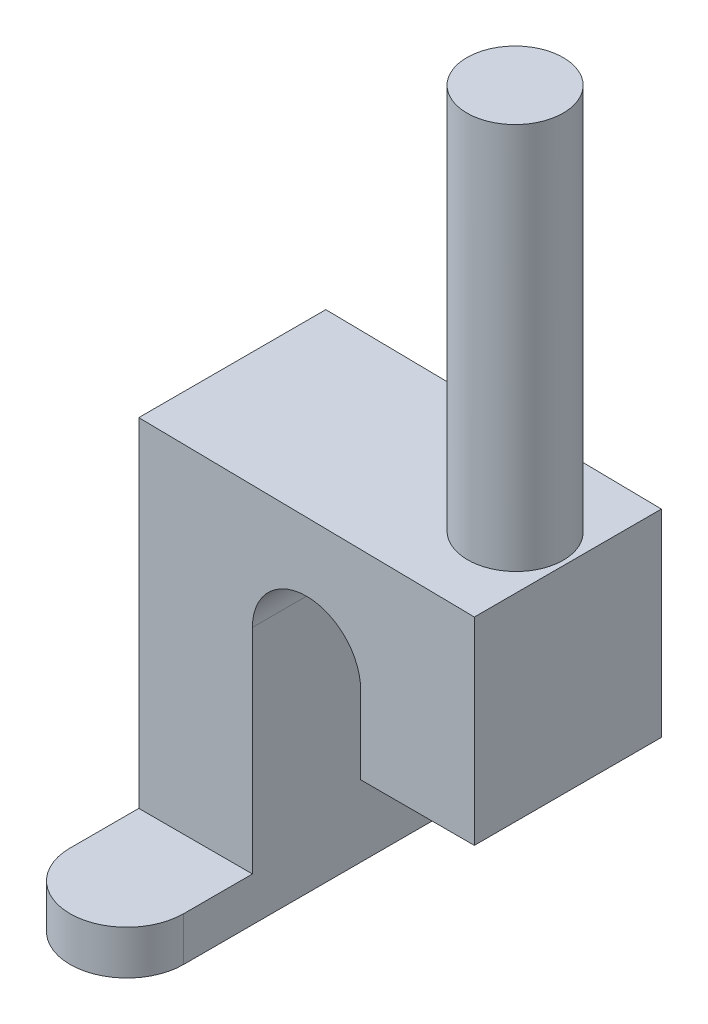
ISO-10303-21;
HEADER;
FILE_DESCRIPTION(('STEP AP214'),'2;1');
FILE_NAME('part.step','',(''),(''),'','','');
FILE_SCHEMA(('AUTOMOTIVE_DESIGN { 1 0 10303 214 1 1 1 1 }'));
ENDSEC;
DATA;
#1=APPLICATION_CONTEXT('core data for automotive mechanical design processes');
#2=APPLICATION_PROTOCOL_DEFINITION('international standard','automotive_design',2000,#1);
#3=PRODUCT_CONTEXT('',#1,'mechanical');
#4=PRODUCT('Part','Part','',(#3));
#5=PRODUCT_RELATED_PRODUCT_CATEGORY('part','',(#4));
#6=PRODUCT_DEFINITION_FORMATION('','',#4);
#7=PRODUCT_DEFINITION_CONTEXT('part definition',#1,'design');
#8=PRODUCT_DEFINITION('design','',#6,#7);
#9=PRODUCT_DEFINITION_SHAPE('','',#8);
#10=(LENGTH_UNIT() NAMED_UNIT(*) SI_UNIT(.MILLI.,.METRE.));
#11=(NAMED_UNIT(*) PLANE_ANGLE_UNIT() SI_UNIT($,.RADIAN.));
#12=(NAMED_UNIT(*) SI_UNIT($,.STERADIAN.) SOLID_ANGLE_UNIT());
#13=UNCERTAINTY_MEASURE_WITH_UNIT(LENGTH_MEASURE(1.E-05),#10,'distance_accuracy_value','');
#14=(GEOMETRIC_REPRESENTATION_CONTEXT(3) GLOBAL_UNCERTAINTY_ASSIGNED_CONTEXT((#13)) GLOBAL_UNIT_ASSIGNED_CONTEXT((#10,
#11,#12)) REPRESENTATION_CONTEXT('',''));
#15=CARTESIAN_POINT('',(0.,0.,0.));
#16=DIRECTION('',(0.,0.,1.));
#17=DIRECTION('',(1.,0.,0.));
#18=AXIS2_PLACEMENT_3D('',#15,#16,#17);
#19=CARTESIAN_POINT('',(0.,0.,4.318));
#20=DIRECTION('',(0.,0.,-1.));
#21=DIRECTION('',(-1.,0.,0.));
#22=AXIS2_PLACEMENT_3D('',#19,#20,#21);
#23=PLANE('',#22);
#24=DIRECTION('',(-1.,0.,0.));
#25=VECTOR('',#24,1.);
#26=CARTESIAN_POINT('',(-7.747,-9.85852398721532,4.318));
#27=LINE('',#26,#25);
#28=CARTESIAN_POINT('',(-2.5,-9.85852398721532,4.318));
#29=VERTEX_POINT('',#28);
#30=CARTESIAN_POINT('',(-7.747,-9.85852398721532,4.318));
#31=VERTEX_POINT('',#30);
#32=EDGE_CURVE('E206',#29,#31,#27,.T.);
#33=ORIENTED_EDGE('',*,*,#32,.F.);
#34=DIRECTION('',(0.,1.,0.));
#35=VECTOR('',#34,1.);
#36=CARTESIAN_POINT('',(-2.5,0.,4.318));
#37=LINE('',#36,#35);
#38=CARTESIAN_POINT('',(-2.5,0.,4.318));
#39=VERTEX_POINT('',#38);
#40=EDGE_CURVE('E139',#29,#39,#37,.T.);
#41=ORIENTED_EDGE('',*,*,#40,.T.);
#42=CARTESIAN_POINT('',(0.,0.,4.318));
#43=DIRECTION('',(0.,0.,-1.));
#44=DIRECTION('',(-1.,0.,0.));
#45=AXIS2_PLACEMENT_3D('',#42,#43,#44);
#46=CIRCLE('',#45,2.5);
#47=CARTESIAN_POINT('',(2.5,0.,4.318));
#48=VERTEX_POINT('',#47);
#49=EDGE_CURVE('E148',#39,#48,#46,.T.);
#50=ORIENTED_EDGE('',*,*,#49,.T.);
#51=DIRECTION('',(0.,-1.,0.));
#52=VECTOR('',#51,1.);
#53=CARTESIAN_POINT('',(2.5,0.,4.318));
#54=LINE('',#53,#52);
#55=CARTESIAN_POINT('',(2.5,-3.59296776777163,4.318));
#56=VERTEX_POINT('',#55);
#57=EDGE_CURVE('E150',#48,#56,#54,.T.);
#58=ORIENTED_EDGE('',*,*,#57,.T.);
#59=DIRECTION('',(1.,0.,0.));
#60=VECTOR('',#59,1.);
#61=CARTESIAN_POINT('',(7.747,-3.59296776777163,4.318));
#62=LINE('',#61,#60);
#63=CARTESIAN_POINT('',(7.747,-3.59296776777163,4.318));
#64=VERTEX_POINT('',#63);
#65=EDGE_CURVE('E152',#56,#64,#62,.T.);
#66=ORIENTED_EDGE('',*,*,#65,.T.);
#67=DIRECTION('',(0.,1.,0.));
#68=VECTOR('',#67,1.);
#69=CARTESIAN_POINT('',(7.747,-3.59296776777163,4.318));
#70=LINE('',#69,#68);
#71=CARTESIAN_POINT('',(7.747,5.54038788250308,4.318));
#72=VERTEX_POINT('',#71);
#73=EDGE_CURVE('E172',#64,#72,#70,.T.);
#74=ORIENTED_EDGE('',*,*,#73,.T.);
#75=DIRECTION('',(-0.999892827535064,0.014640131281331,0.));
#76=VECTOR('',#75,1.);
#77=CARTESIAN_POINT('',(2.873732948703,5.61174079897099,4.318));
#78=LINE('',#77,#76);
#79=CARTESIAN_POINT('',(-7.747,5.76724638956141,4.318));
#80=VERTEX_POINT('',#79);
#81=EDGE_CURVE('E140',#72,#80,#78,.T.);
#82=ORIENTED_EDGE('',*,*,#81,.T.);
#83=DIRECTION('',(0.,-1.,0.));
#84=VECTOR('',#83,1.);
#85=CARTESIAN_POINT('',(-7.747,5.76724638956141,4.318));
#86=LINE('',#85,#84);
#87=EDGE_CURVE('E135',#80,#31,#86,.T.);
#88=ORIENTED_EDGE('',*,*,#87,.T.);
#89=EDGE_LOOP('',(#33,#41,#50,#58,#66,#74,#82,#88));
#90=FACE_BOUND('',#89,.T.);
#91=ADVANCED_FACE('F33',(#90),#23,.F.);
#92=CARTESIAN_POINT('',(7.747,-3.59296776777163,4.318));
#93=DIRECTION('',(-1.,0.,0.));
#94=DIRECTION('',(0.,0.,1.));
#95=AXIS2_PLACEMENT_3D('',#92,#93,#94);
#96=PLANE('',#95);
#97=DIRECTION('',(0.,1.,0.));
#98=VECTOR('',#97,1.);
#99=CARTESIAN_POINT('',(7.747,-3.59296776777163,-4.318));
#100=LINE('',#99,#98);
#101=CARTESIAN_POINT('',(7.747,-3.59296776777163,-4.318));
#102=VERTEX_POINT('',#101);
#103=CARTESIAN_POINT('',(7.747,5.54038788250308,-4.318));
#104=VERTEX_POINT('',#103);
#105=EDGE_CURVE('E155',#102,#104,#100,.T.);
#106=ORIENTED_EDGE('',*,*,#105,.T.);
#107=DIRECTION('',(0.,0.,1.));
#108=VECTOR('',#107,1.);
#109=CARTESIAN_POINT('',(7.747,5.54038788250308,4.318));
#110=LINE('',#109,#108);
#111=EDGE_CURVE('E159',#104,#72,#110,.T.);
#112=ORIENTED_EDGE('',*,*,#111,.T.);
#113=ORIENTED_EDGE('',*,*,#73,.F.);
#114=DIRECTION('',(0.,0.,-1.));
#115=VECTOR('',#114,1.);
#116=CARTESIAN_POINT('',(7.747,-3.59296776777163,4.318));
#117=LINE('',#116,#115);
#118=EDGE_CURVE('E154',#64,#102,#117,.T.);
#119=ORIENTED_EDGE('',*,*,#118,.T.);
#120=EDGE_LOOP('',(#106,#112,#113,#119));
#121=FACE_BOUND('',#120,.T.);
#122=ADVANCED_FACE('F35',(#121),#96,.F.);
#123=CARTESIAN_POINT('',(2.873732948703,5.61174079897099,4.318));
#124=DIRECTION('',(-0.014640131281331,-0.999892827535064,0.));
#125=DIRECTION('',(0.999892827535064,-0.014640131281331,0.));
#126=AXIS2_PLACEMENT_3D('',#123,#124,#125);
#127=PLANE('',#126);
#128=DIRECTION('',(0.,0.,-1.));
#129=VECTOR('',#128,1.);
#130=CARTESIAN_POINT('',(-7.747,5.76724638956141,4.318));
#131=LINE('',#130,#129);
#132=CARTESIAN_POINT('',(-7.747,5.76724638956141,-4.318));
#133=VERTEX_POINT('',#132);
#134=EDGE_CURVE('E41',#80,#133,#131,.T.);
#135=ORIENTED_EDGE('',*,*,#134,.F.);
#136=ORIENTED_EDGE('',*,*,#81,.F.);
#137=ORIENTED_EDGE('',*,*,#111,.F.);
#138=DIRECTION('',(-0.999892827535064,0.014640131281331,0.));
#139=VECTOR('',#138,1.);
#140=CARTESIAN_POINT('',(2.873732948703,5.61174079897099,-4.318));
#141=LINE('',#140,#139);
#142=EDGE_CURVE('E158',#104,#133,#141,.T.);
#143=ORIENTED_EDGE('',*,*,#142,.T.);
#144=EDGE_LOOP('',(#135,#136,#137,#143));
#145=FACE_BOUND('',#144,.T.);
#146=CARTESIAN_POINT('',(5.310366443,5.57606434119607,0.));
#147=DIRECTION('',(-0.014640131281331,-0.999892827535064,0.));
#148=DIRECTION('',(-0.999892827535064,0.014640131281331,0.));
#149=AXIS2_PLACEMENT_3D('',#146,#147,#148);
#150=ELLIPSE('',#149,2.22273821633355,2.2225);
#151=CARTESIAN_POINT('',(3.087866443,5.60860552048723,0.));
#152=VERTEX_POINT('',#151);
#153=EDGE_CURVE('E211',#152,#152,#150,.F.);
#154=ORIENTED_EDGE('',*,*,#153,.F.);
#155=EDGE_LOOP('',(#154));
#156=FACE_BOUND('',#155,.T.);
#157=ADVANCED_FACE('F229',(#145,#156),#127,.F.);
#158=CARTESIAN_POINT('',(-7.747,5.76724638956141,4.318));
#159=DIRECTION('',(1.,0.,0.));
#160=DIRECTION('',(0.,1.,0.));
#161=AXIS2_PLACEMENT_3D('',#158,#159,#160);
#162=PLANE('',#161);
#163=DIRECTION('',(0.,0.,-1.));
#164=VECTOR('',#163,1.);
#165=CARTESIAN_POINT('',(-7.747,-11.8905239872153,4.318));
#166=LINE('',#165,#164);
#167=CARTESIAN_POINT('',(-7.747,-11.8905239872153,7.493));
#168=VERTEX_POINT('',#167);
#169=CARTESIAN_POINT('',(-7.747,-11.8905239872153,-4.318));
#170=VERTEX_POINT('',#169);
#171=EDGE_CURVE('E120',#168,#170,#166,.T.);
#172=ORIENTED_EDGE('',*,*,#171,.F.);
#173=DIRECTION('',(0.,1.,0.));
#174=VECTOR('',#173,1.);
#175=CARTESIAN_POINT('',(-7.747,-11.8905239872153,7.493));
#176=LINE('',#175,#174);
#177=CARTESIAN_POINT('',(-7.747,-9.85852398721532,7.493));
#178=VERTEX_POINT('',#177);
#179=EDGE_CURVE('E108',#168,#178,#176,.T.);
#180=ORIENTED_EDGE('',*,*,#179,.T.);
#181=DIRECTION('',(0.,0.,-1.));
#182=VECTOR('',#181,1.);
#183=CARTESIAN_POINT('',(-7.747,-9.85852398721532,10.668));
#184=LINE('',#183,#182);
#185=EDGE_CURVE('E209',#178,#31,#184,.T.);
#186=ORIENTED_EDGE('',*,*,#185,.T.);
#187=ORIENTED_EDGE('',*,*,#87,.F.);
#188=ORIENTED_EDGE('',*,*,#134,.T.);
#189=DIRECTION('',(0.,-1.,0.));
#190=VECTOR('',#189,1.);
#191=CARTESIAN_POINT('',(-7.747,5.76724638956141,-4.318));
#192=LINE('',#191,#190);
#193=EDGE_CURVE('E127',#133,#170,#192,.T.);
#194=ORIENTED_EDGE('',*,*,#193,.T.);
#195=EDGE_LOOP('',(#172,#180,#186,#187,#188,#194));
#196=FACE_BOUND('',#195,.T.);
#197=ADVANCED_FACE('F124',(#196),#162,.F.);
#198=CARTESIAN_POINT('',(-7.747,-11.8905239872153,4.318));
#199=DIRECTION('',(0.,1.,0.));
#200=DIRECTION('',(0.,0.,1.));
#201=AXIS2_PLACEMENT_3D('',#198,#199,#200);
#202=PLANE('',#201);
#203=DIRECTION('',(0.,0.,-1.));
#204=VECTOR('',#203,1.);
#205=CARTESIAN_POINT('',(-2.5,-11.8905239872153,4.318));
#206=LINE('',#205,#204);
#207=CARTESIAN_POINT('',(-2.5,-11.8905239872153,7.493));
#208=VERTEX_POINT('',#207);
#209=CARTESIAN_POINT('',(-2.5,-11.8905239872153,-4.318));
#210=VERTEX_POINT('',#209);
#211=EDGE_CURVE('E122',#208,#210,#206,.T.);
#212=ORIENTED_EDGE('',*,*,#211,.F.);
#213=CARTESIAN_POINT('',(-5.1235,-11.8905239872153,7.493));
#214=DIRECTION('',(0.,-1.,0.));
#215=DIRECTION('',(0.,0.,1.));
#216=AXIS2_PLACEMENT_3D('',#213,#214,#215);
#217=CIRCLE('',#216,2.6235);
#218=EDGE_CURVE('E111',#208,#168,#217,.T.);
#219=ORIENTED_EDGE('',*,*,#218,.T.);
#220=ORIENTED_EDGE('',*,*,#171,.T.);
#221=DIRECTION('',(1.,0.,0.));
#222=VECTOR('',#221,1.);
#223=CARTESIAN_POINT('',(-7.747,-11.8905239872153,-4.318));
#224=LINE('',#223,#222);
#225=EDGE_CURVE('E162',#170,#210,#224,.T.);
#226=ORIENTED_EDGE('',*,*,#225,.T.);
#227=EDGE_LOOP('',(#212,#219,#220,#226));
#228=FACE_BOUND('',#227,.T.);
#229=ADVANCED_FACE('F118',(#228),#202,.F.);
#230=CARTESIAN_POINT('',(-2.5,0.,4.318));
#231=DIRECTION('',(-1.,0.,0.));
#232=DIRECTION('',(0.,0.,1.));
#233=AXIS2_PLACEMENT_3D('',#230,#231,#232);
#234=PLANE('',#233);
#235=DIRECTION('',(0.,0.,-1.));
#236=VECTOR('',#235,1.);
#237=CARTESIAN_POINT('',(-2.5,-9.85852398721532,10.668));
#238=LINE('',#237,#236);
#239=CARTESIAN_POINT('',(-2.5,-9.85852398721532,7.493));
#240=VERTEX_POINT('',#239);
#241=EDGE_CURVE('E54',#240,#29,#238,.T.);
#242=ORIENTED_EDGE('',*,*,#241,.F.);
#243=DIRECTION('',(0.,1.,0.));
#244=VECTOR('',#243,1.);
#245=CARTESIAN_POINT('',(-2.5,-11.8905239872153,7.493));
#246=LINE('',#245,#244);
#247=EDGE_CURVE('E48',#208,#240,#246,.T.);
#248=ORIENTED_EDGE('',*,*,#247,.F.);
#249=ORIENTED_EDGE('',*,*,#211,.T.);
#250=DIRECTION('',(0.,1.,0.));
#251=VECTOR('',#250,1.);
#252=CARTESIAN_POINT('',(-2.5,0.,-4.318));
#253=LINE('',#252,#251);
#254=CARTESIAN_POINT('',(-2.5,0.,-4.318));
#255=VERTEX_POINT('',#254);
#256=EDGE_CURVE('E164',#210,#255,#253,.T.);
#257=ORIENTED_EDGE('',*,*,#256,.T.);
#258=DIRECTION('',(0.,0.,-1.));
#259=VECTOR('',#258,1.);
#260=CARTESIAN_POINT('',(-2.5,0.,4.318));
#261=LINE('',#260,#259);
#262=EDGE_CURVE('E131',#39,#255,#261,.T.);
#263=ORIENTED_EDGE('',*,*,#262,.F.);
#264=ORIENTED_EDGE('',*,*,#40,.F.);
#265=EDGE_LOOP('',(#242,#248,#249,#257,#263,#264));
#266=FACE_BOUND('',#265,.T.);
#267=ADVANCED_FACE('F207',(#266),#234,.F.);
#268=CARTESIAN_POINT('',(0.,0.,4.318));
#269=DIRECTION('',(0.,0.,-1.));
#270=DIRECTION('',(-1.,0.,0.));
#271=AXIS2_PLACEMENT_3D('',#268,#269,#270);
#272=CYLINDRICAL_SURFACE('',#271,2.5);
#273=CARTESIAN_POINT('',(0.,0.,-4.318));
#274=DIRECTION('',(0.,0.,-1.));
#275=DIRECTION('',(-1.,0.,0.));
#276=AXIS2_PLACEMENT_3D('',#273,#274,#275);
#277=CIRCLE('',#276,2.5);
#278=CARTESIAN_POINT('',(2.5,0.,-4.318));
#279=VERTEX_POINT('',#278);
#280=EDGE_CURVE('E166',#255,#279,#277,.T.);
#281=ORIENTED_EDGE('',*,*,#280,.T.);
#282=DIRECTION('',(0.,0.,-1.));
#283=VECTOR('',#282,1.);
#284=CARTESIAN_POINT('',(2.5,0.,4.318));
#285=LINE('',#284,#283);
#286=EDGE_CURVE('E178',#48,#279,#285,.T.);
#287=ORIENTED_EDGE('',*,*,#286,.F.);
#288=ORIENTED_EDGE('',*,*,#49,.F.);
#289=ORIENTED_EDGE('',*,*,#262,.T.);
#290=EDGE_LOOP('',(#281,#287,#288,#289));
#291=FACE_BOUND('',#290,.T.);
#292=ADVANCED_FACE('F185',(#291),#272,.F.);
#293=CARTESIAN_POINT('',(2.5,0.,4.318));
#294=DIRECTION('',(1.,0.,0.));
#295=DIRECTION('',(0.,0.,-1.));
#296=AXIS2_PLACEMENT_3D('',#293,#294,#295);
#297=PLANE('',#296);
#298=DIRECTION('',(0.,-1.,0.));
#299=VECTOR('',#298,1.);
#300=CARTESIAN_POINT('',(2.5,0.,-4.318));
#301=LINE('',#300,#299);
#302=CARTESIAN_POINT('',(2.5,-3.59296776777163,-4.318));
#303=VERTEX_POINT('',#302);
#304=EDGE_CURVE('E168',#279,#303,#301,.T.);
#305=ORIENTED_EDGE('',*,*,#304,.T.);
#306=DIRECTION('',(0.,0.,-1.));
#307=VECTOR('',#306,1.);
#308=CARTESIAN_POINT('',(2.5,-3.59296776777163,4.318));
#309=LINE('',#308,#307);
#310=EDGE_CURVE('E175',#56,#303,#309,.T.);
#311=ORIENTED_EDGE('',*,*,#310,.F.);
#312=ORIENTED_EDGE('',*,*,#57,.F.);
#313=ORIENTED_EDGE('',*,*,#286,.T.);
#314=EDGE_LOOP('',(#305,#311,#312,#313));
#315=FACE_BOUND('',#314,.T.);
#316=ADVANCED_FACE('F197',(#315),#297,.F.);
#317=CARTESIAN_POINT('',(7.747,-3.59296776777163,4.318));
#318=DIRECTION('',(0.,1.,0.));
#319=DIRECTION('',(0.,0.,1.));
#320=AXIS2_PLACEMENT_3D('',#317,#318,#319);
#321=PLANE('',#320);
#322=DIRECTION('',(1.,0.,0.));
#323=VECTOR('',#322,1.);
#324=CARTESIAN_POINT('',(7.747,-3.59296776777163,-4.318));
#325=LINE('',#324,#323);
#326=EDGE_CURVE('E170',#303,#102,#325,.T.);
#327=ORIENTED_EDGE('',*,*,#326,.T.);
#328=ORIENTED_EDGE('',*,*,#118,.F.);
#329=ORIENTED_EDGE('',*,*,#65,.F.);
#330=ORIENTED_EDGE('',*,*,#310,.T.);
#331=EDGE_LOOP('',(#327,#328,#329,#330));
#332=FACE_BOUND('',#331,.T.);
#333=ADVANCED_FACE('F201',(#332),#321,.F.);
#334=CARTESIAN_POINT('',(0.,0.,-4.318));
#335=DIRECTION('',(0.,0.,-1.));
#336=DIRECTION('',(-1.,0.,0.));
#337=AXIS2_PLACEMENT_3D('',#334,#335,#336);
#338=PLANE('',#337);
#339=ORIENTED_EDGE('',*,*,#142,.F.);
#340=ORIENTED_EDGE('',*,*,#105,.F.);
#341=ORIENTED_EDGE('',*,*,#326,.F.);
#342=ORIENTED_EDGE('',*,*,#304,.F.);
#343=ORIENTED_EDGE('',*,*,#280,.F.);
#344=ORIENTED_EDGE('',*,*,#256,.F.);
#345=ORIENTED_EDGE('',*,*,#225,.F.);
#346=ORIENTED_EDGE('',*,*,#193,.F.);
#347=EDGE_LOOP('',(#339,#340,#341,#342,#343,#344,#345,#346));
#348=FACE_BOUND('',#347,.T.);
#349=ADVANCED_FACE('F192',(#348),#338,.T.);
#350=CARTESIAN_POINT('',(5.310366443,-8.41832891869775,0.));
#351=DIRECTION('',(0.,1.,0.));
#352=DIRECTION('',(0.,0.,1.));
#353=AXIS2_PLACEMENT_3D('',#350,#351,#352);
#354=CYLINDRICAL_SURFACE('',#353,2.2225);
#355=CARTESIAN_POINT('',(5.310366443,23.4250169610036,0.));
#356=DIRECTION('',(0.,1.,0.));
#357=DIRECTION('',(0.,0.,1.));
#358=AXIS2_PLACEMENT_3D('',#355,#356,#357);
#359=CIRCLE('',#358,2.2225);
#360=CARTESIAN_POINT('',(5.310366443,23.4250169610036,2.2225));
#361=VERTEX_POINT('',#360);
#362=EDGE_CURVE('E208',#361,#361,#359,.T.);
#363=ORIENTED_EDGE('',*,*,#362,.F.);
#364=EDGE_LOOP('',(#363));
#365=FACE_BOUND('',#364,.T.);
#366=ORIENTED_EDGE('',*,*,#153,.T.);
#367=EDGE_LOOP('',(#366));
#368=FACE_BOUND('',#367,.T.);
#369=ADVANCED_FACE('F240',(#365,#368),#354,.T.);
#370=CARTESIAN_POINT('',(7.747,23.4250169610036,4.318));
#371=DIRECTION('',(0.,-1.,0.));
#372=DIRECTION('',(0.,0.,-1.));
#373=AXIS2_PLACEMENT_3D('',#370,#371,#372);
#374=PLANE('',#373);
#375=ORIENTED_EDGE('',*,*,#362,.T.);
#376=EDGE_LOOP('',(#375));
#377=FACE_BOUND('',#376,.T.);
#378=ADVANCED_FACE('F233',(#377),#374,.F.);
#379=CARTESIAN_POINT('',(-7.747,-9.85852398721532,10.668));
#380=DIRECTION('',(0.,-1.,0.));
#381=DIRECTION('',(0.,0.,-1.));
#382=AXIS2_PLACEMENT_3D('',#379,#380,#381);
#383=PLANE('',#382);
#384=ORIENTED_EDGE('',*,*,#185,.F.);
#385=CARTESIAN_POINT('',(-5.1235,-9.85852398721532,7.493));
#386=DIRECTION('',(0.,-1.,0.));
#387=DIRECTION('',(0.,0.,-1.));
#388=AXIS2_PLACEMENT_3D('',#385,#386,#387);
#389=CIRCLE('',#388,2.6235);
#390=EDGE_CURVE('E11',#178,#240,#389,.F.);
#391=ORIENTED_EDGE('',*,*,#390,.T.);
#392=ORIENTED_EDGE('',*,*,#241,.T.);
#393=ORIENTED_EDGE('',*,*,#32,.T.);
#394=EDGE_LOOP('',(#384,#391,#392,#393));
#395=FACE_BOUND('',#394,.T.);
#396=ADVANCED_FACE('F231',(#395),#383,.F.);
#397=CARTESIAN_POINT('',(-5.1235,-11.8905239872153,7.493));
#398=DIRECTION('',(0.,1.,0.));
#399=DIRECTION('',(0.,0.,1.));
#400=AXIS2_PLACEMENT_3D('',#397,#398,#399);
#401=CYLINDRICAL_SURFACE('',#400,2.6235);
#402=ORIENTED_EDGE('',*,*,#179,.F.);
#403=ORIENTED_EDGE('',*,*,#218,.F.);
#404=ORIENTED_EDGE('',*,*,#247,.T.);
#405=ORIENTED_EDGE('',*,*,#390,.F.);
#406=EDGE_LOOP('',(#402,#403,#404,#405));
#407=FACE_BOUND('',#406,.T.);
#408=ADVANCED_FACE('F110',(#407),#401,.T.);
#409=CLOSED_SHELL('',(#91,#122,#157,#197,#229,#267,#292,#316,#333,#349,#369,#378,#396,#408));
#410=MANIFOLD_SOLID_BREP('B2',#409);
#411=ADVANCED_BREP_SHAPE_REPRESENTATION('',(#18,#410),#14);
#412=SHAPE_DEFINITION_REPRESENTATION(#9,#411);
ENDSEC;
END-ISO-10303-21;
